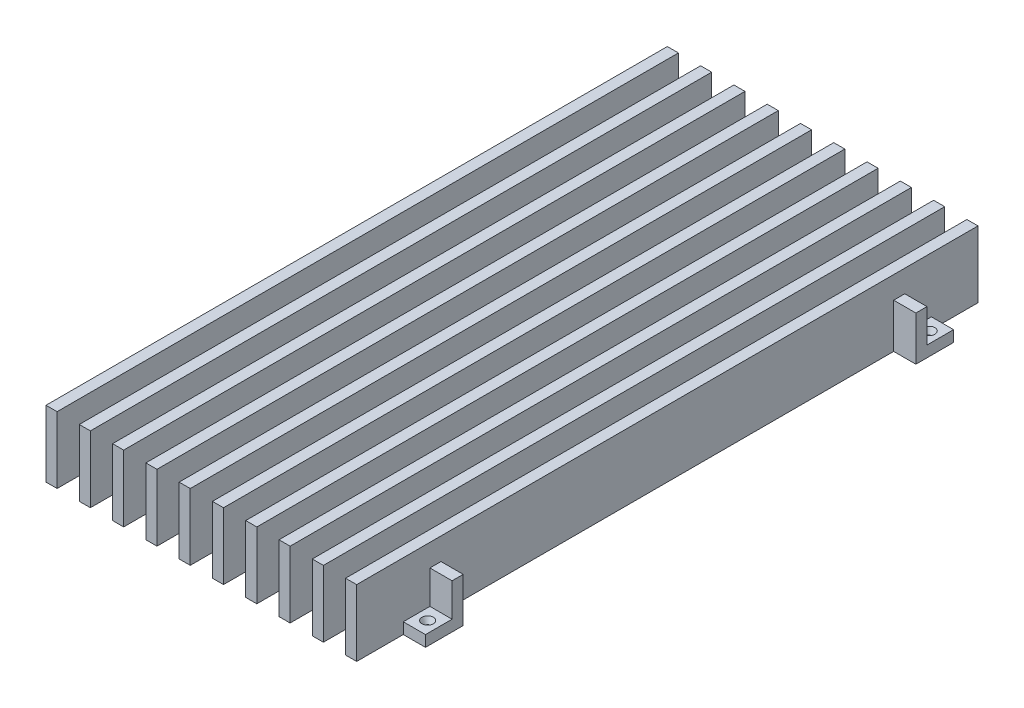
from build123d import *

# Parameters (mm, degrees)
SKETCH1_W           = 3.175
SKETCH1_H           = 19.05
BOSS_EXTRUDE1_DEPTH = 177.8
LPATTERN1_COUNT     = 10
LPATTERN1_PITCH     = 9.525
SKETCH2_W           = 3.175
SKETCH2_H           = 12.7
BOSS_EXTRUDE2_DEPTH = 50.8
SKETCH3_W           = 6.35
SKETCH3_H           = 7.62
BOSS_EXTRUDE3_DEPTH = 3.175


with BuildPart() as part:
    # Sketch1 → Boss-Extrude1 (new body)
    with BuildSketch(Plane.XY):
        Rectangle(SKETCH1_W, SKETCH1_H)
    extrude(amount=-BOSS_EXTRUDE1_DEPTH)


with BuildPart() as lpattern1_1:
    # LPattern1: pattern copy
    add(part.part.moved(Location(Vector(1, 0, 0) * (1 * LPATTERN1_PITCH))))


with BuildPart() as lpattern1_2:
    # LPattern1: pattern copy
    add(part.part.moved(Location(Vector(1, 0, 0) * (2 * LPATTERN1_PITCH))))


with BuildPart() as lpattern1_3:
    # LPattern1: pattern copy
    add(part.part.moved(Location(Vector(1, 0, 0) * (3 * LPATTERN1_PITCH))))


with BuildPart() as lpattern1_4:
    # LPattern1: pattern copy
    add(part.part.moved(Location(Vector(1, 0, 0) * (4 * LPATTERN1_PITCH))))


with BuildPart() as lpattern1_5:
    # LPattern1: pattern copy
    add(part.part.moved(Location(Vector(1, 0, 0) * (5 * LPATTERN1_PITCH))))


with BuildPart() as lpattern1_6:
    # LPattern1: pattern copy
    add(part.part.moved(Location(Vector(1, 0, 0) * (6 * LPATTERN1_PITCH))))


with BuildPart() as lpattern1_7:
    # LPattern1: pattern copy
    add(part.part.moved(Location(Vector(1, 0, 0) * (7 * LPATTERN1_PITCH))))


with BuildPart() as lpattern1_8:
    # LPattern1: pattern copy
    add(part.part.moved(Location(Vector(1, 0, 0) * (8 * LPATTERN1_PITCH))))


with BuildPart() as lpattern1_9:
    # LPattern1: pattern copy
    add(part.part.moved(Location(Vector(1, 0, 0) * (9 * LPATTERN1_PITCH))))


with BuildPart() as part_1:
    add(part.part)

    add(lpattern1_1.part)  # Boss-Extrude2 merges LPattern1_1

    add(lpattern1_2.part)  # Boss-Extrude2 merges LPattern1_2

    add(lpattern1_3.part)  # Boss-Extrude2 merges LPattern1_3

    add(lpattern1_4.part)  # Boss-Extrude2 merges LPattern1_4

    add(lpattern1_5.part)  # Boss-Extrude2 merges LPattern1_5

    add(lpattern1_6.part)  # Boss-Extrude2 merges LPattern1_6

    add(lpattern1_7.part)  # Boss-Extrude2 merges LPattern1_7

    add(lpattern1_8.part)  # Boss-Extrude2 merges LPattern1_8

    add(lpattern1_9.part)  # Boss-Extrude2 merges LPattern1_9
    # Sketch2 → Boss-Extrude2 (add, symmetric)
    with BuildSketch(Plane.ZY.offset(-42.8625)):
        with Locations((-155.2575, -3.175)):
            Rectangle(SKETCH2_W, SKETCH2_H)
        with Locations((-22.5425, -3.175)):
            Rectangle(SKETCH2_W, SKETCH2_H)
    extrude(amount=BOSS_EXTRUDE2_DEPTH, both=True)

    # Sketch3 → Boss-Extrude3 (add)
    with BuildSketch(Plane.XZ.offset(9.525)):
        with Locations((-4.7625, -17.145)):
            Rectangle(SKETCH3_W, SKETCH3_H)
        with Locations((90.4875, -17.145)):
            Rectangle(SKETCH3_W, SKETCH3_H)
        with Locations((90.4875, -160.655)):
            Rectangle(SKETCH3_W, SKETCH3_H)
        with Locations((-4.7625, -160.655)):
            Rectangle(SKETCH3_W, SKETCH3_H)
    extrude(amount=-BOSS_EXTRUDE3_DEPTH)

    # Sketch5 → Cut-Revolve1 (revolve, cut)
    with BuildSketch(Plane(origin=(0, 0, -160.655), x_dir=(-1, 0, 0), z_dir=(0, 0, -1)), mode=Mode.PRIVATE) as cut_revolve1_sk:
        Polygon((-90.4875, -6.35), (-90.4875, -7.9375), (-90.4875, -9.525), (-89.69375, -9.525), (-89.69375, -7.9375), (-88.849661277, -6.35), align=None)
    cut_revolve1 = revolve(cut_revolve1_sk.sketch.rotate(Axis((90.4875, -6.35, -160.655), (0, -1, 0)), 270), axis=Axis((90.4875, -6.35, -160.655), (0, -1, 0)), mode=Mode.SUBTRACT)

    # Sketch-Pattern1: Cut-Revolve1 at 3 more places
    with Locations((-95.25, 0, 0), (-95.25, 0, 143.51), (0, 0, 143.51)):
        add(cut_revolve1, mode=Mode.SUBTRACT)


solid = part_1.part
